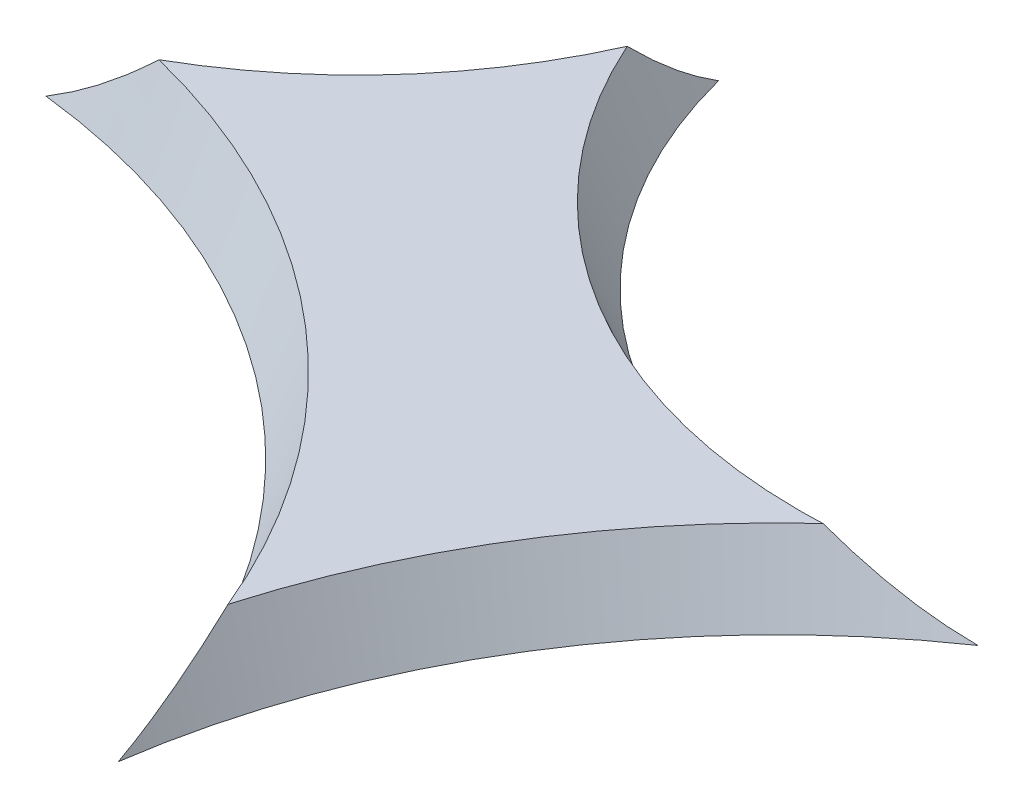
ISO-10303-21;
HEADER;
FILE_DESCRIPTION(('STEP AP214'),'2;1');
FILE_NAME('part.step','',(''),(''),'','','');
FILE_SCHEMA(('AUTOMOTIVE_DESIGN { 1 0 10303 214 1 1 1 1 }'));
ENDSEC;
DATA;
#1=APPLICATION_CONTEXT('core data for automotive mechanical design processes');
#2=APPLICATION_PROTOCOL_DEFINITION('international standard','automotive_design',2000,#1);
#3=PRODUCT_CONTEXT('',#1,'mechanical');
#4=PRODUCT('Part','Part','',(#3));
#5=PRODUCT_RELATED_PRODUCT_CATEGORY('part','',(#4));
#6=PRODUCT_DEFINITION_FORMATION('','',#4);
#7=PRODUCT_DEFINITION_CONTEXT('part definition',#1,'design');
#8=PRODUCT_DEFINITION('design','',#6,#7);
#9=PRODUCT_DEFINITION_SHAPE('','',#8);
#10=(LENGTH_UNIT() NAMED_UNIT(*) SI_UNIT(.MILLI.,.METRE.));
#11=(NAMED_UNIT(*) PLANE_ANGLE_UNIT() SI_UNIT($,.RADIAN.));
#12=(NAMED_UNIT(*) SI_UNIT($,.STERADIAN.) SOLID_ANGLE_UNIT());
#13=UNCERTAINTY_MEASURE_WITH_UNIT(LENGTH_MEASURE(1.E-05),#10,'distance_accuracy_value','');
#14=(GEOMETRIC_REPRESENTATION_CONTEXT(3) GLOBAL_UNCERTAINTY_ASSIGNED_CONTEXT((#13)) GLOBAL_UNIT_ASSIGNED_CONTEXT((#10,
#11,#12)) REPRESENTATION_CONTEXT('',''));
#15=CARTESIAN_POINT('',(0.,0.,0.));
#16=DIRECTION('',(0.,0.,1.));
#17=DIRECTION('',(1.,0.,0.));
#18=AXIS2_PLACEMENT_3D('',#15,#16,#17);
#19=CARTESIAN_POINT('',(-32.,12.,1.3));
#20=DIRECTION('',(0.,1.,0.));
#21=DIRECTION('',(0.,0.,1.));
#22=AXIS2_PLACEMENT_3D('',#19,#20,#21);
#23=CONICAL_SURFACE('',#22,8.49,0.380506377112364);
#24=CARTESIAN_POINT('',(-31.0491448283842,12.0000000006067,-7.13658547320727));
#25=CARTESIAN_POINT('',(-30.9989807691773,12.0277789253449,-7.14211384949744));
#26=CARTESIAN_POINT('',(-30.9493711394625,12.0565388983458,-7.14767636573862));
#27=CARTESIAN_POINT('',(-30.8501212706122,12.1165249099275,-7.15898165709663));
#28=CARTESIAN_POINT('',(-30.8005060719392,12.1477921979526,-7.16472565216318));
#29=CARTESIAN_POINT('',(-30.7012075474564,12.2127899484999,-7.17639148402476));
#30=CARTESIAN_POINT('',(-30.6515513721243,12.2465616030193,-7.18231427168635));
#31=CARTESIAN_POINT('',(-30.5521315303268,12.3165690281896,-7.19433835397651));
#32=CARTESIAN_POINT('',(-30.5023966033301,12.3528454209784,-7.20044039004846));
#33=CARTESIAN_POINT('',(-30.4027826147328,12.4278628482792,-7.2128249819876));
#34=CARTESIAN_POINT('',(-30.3529334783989,12.4666434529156,-7.21910810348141));
#35=CARTESIAN_POINT('',(-30.2530559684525,12.5466708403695,-7.23185853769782));
#36=CARTESIAN_POINT('',(-30.2030582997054,12.5879558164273,-7.23832629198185));
#37=CARTESIAN_POINT('',(-30.1028503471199,12.6729923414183,-7.25145089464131));
#38=CARTESIAN_POINT('',(-30.0526711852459,12.7167804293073,-7.25810810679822));
#39=CARTESIAN_POINT('',(-29.9520691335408,12.8068291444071,-7.27161824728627));
#40=CARTESIAN_POINT('',(-29.9016774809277,12.8531246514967,-7.27847152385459));
#41=CARTESIAN_POINT('',(-29.8518383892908,12.900000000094,-7.28533061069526));
#42=B_SPLINE_CURVE_WITH_KNOTS('',3,(#24,#25,#26,#27,#28,#29,#30,#31,#32,#33,#34,#35,#36,#37,#38,
#39,#40,#41),.UNSPECIFIED.,.F.,.F.,(4,2,2,2,2,2,2,2,4),(0.,0.172803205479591,0.349542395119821,
0.530539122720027,0.716090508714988,0.906470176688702,1.10192941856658,1.30269850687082,
1.50898808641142),.UNSPECIFIED.);
#43=CARTESIAN_POINT('',(-31.0491448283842,12.0000000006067,-7.13658547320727));
#44=VERTEX_POINT('',#43);
#45=CARTESIAN_POINT('',(-29.8518383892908,12.900000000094,-7.28533061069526));
#46=VERTEX_POINT('',#45);
#47=EDGE_CURVE('E11',#44,#46,#42,.T.);
#48=ORIENTED_EDGE('',*,*,#47,.F.);
#49=CARTESIAN_POINT('',(-32.,12.,1.3));
#50=DIRECTION('',(0.,1.,0.));
#51=DIRECTION('',(0.,0.,1.));
#52=AXIS2_PLACEMENT_3D('',#49,#50,#51);
#53=CIRCLE('',#52,8.49);
#54=CARTESIAN_POINT('',(-23.7484033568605,12.0000000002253,-0.697812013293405));
#55=VERTEX_POINT('',#54);
#56=EDGE_CURVE('E75',#55,#44,#53,.T.);
#57=ORIENTED_EDGE('',*,*,#56,.F.);
#58=CARTESIAN_POINT('',(-23.8193803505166,12.9000000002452,-2.07638299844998));
#59=CARTESIAN_POINT('',(-23.816252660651,12.8524980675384,-2.0189980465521));
#60=CARTESIAN_POINT('',(-23.8131104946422,12.8056964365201,-1.96102786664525));
#61=CARTESIAN_POINT('',(-23.8068776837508,12.7147823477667,-1.84527738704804));
#62=CARTESIAN_POINT('',(-23.8037876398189,12.6706321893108,-1.78752663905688));
#63=CARTESIAN_POINT('',(-23.7976610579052,12.5850185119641,-1.6721829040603));
#64=CARTESIAN_POINT('',(-23.7946249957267,12.5435160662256,-1.61461884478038));
#65=CARTESIAN_POINT('',(-23.7886071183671,12.4632001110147,-1.49961655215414));
#66=CARTESIAN_POINT('',(-23.7856256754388,12.4243465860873,-1.44220628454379));
#67=CARTESIAN_POINT('',(-23.7797165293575,12.3493291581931,-1.32747901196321));
#68=CARTESIAN_POINT('',(-23.7767891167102,12.3131245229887,-1.27018867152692));
#69=CARTESIAN_POINT('',(-23.7709861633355,12.2434056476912,-1.15566873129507));
#70=CARTESIAN_POINT('',(-23.7681108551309,12.2098503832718,-1.098464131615));
#71=CARTESIAN_POINT('',(-23.7624089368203,12.1454300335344,-0.984081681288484));
#72=CARTESIAN_POINT('',(-23.7595825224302,12.1145241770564,-0.926926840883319));
#73=CARTESIAN_POINT('',(-23.7539734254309,12.0554034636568,-0.81261394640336));
#74=CARTESIAN_POINT('',(-23.7511909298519,12.0271486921,-0.75547650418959));
#75=CARTESIAN_POINT('',(-23.7484033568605,12.0000000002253,-0.697812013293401));
#76=B_SPLINE_CURVE_WITH_KNOTS('',3,(#58,#59,#60,#61,#62,#63,#64,#65,#66,#67,#68,#69,#70,#71,#72,
#73,#74,#75),.UNSPECIFIED.,.F.,.F.,(4,2,2,2,2,2,2,2,4),(0.,0.223682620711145,0.441935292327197,
0.654996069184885,0.863122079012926,1.06659048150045,1.26569927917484,1.46076792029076,
1.65213762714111),.UNSPECIFIED.);
#77=CARTESIAN_POINT('',(-23.8193803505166,12.9000000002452,-2.07638299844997));
#78=VERTEX_POINT('',#77);
#79=EDGE_CURVE('E27',#78,#55,#76,.T.);
#80=ORIENTED_EDGE('',*,*,#79,.F.);
#81=CARTESIAN_POINT('',(-32.,12.9,1.3));
#82=DIRECTION('',(0.,1.,0.));
#83=DIRECTION('',(0.,0.,1.));
#84=AXIS2_PLACEMENT_3D('',#81,#82,#83);
#85=CIRCLE('',#84,8.85);
#86=EDGE_CURVE('E78',#78,#46,#85,.T.);
#87=ORIENTED_EDGE('',*,*,#86,.T.);
#88=EDGE_LOOP('',(#48,#57,#80,#87));
#89=FACE_BOUND('',#88,.T.);
#90=ADVANCED_FACE('F16',(#89),#23,.F.);
#91=CARTESIAN_POINT('',(-33.,12.,-12.8));
#92=DIRECTION('',(0.,1.,0.));
#93=DIRECTION('',(0.,0.,1.));
#94=AXIS2_PLACEMENT_3D('',#91,#92,#93);
#95=CONICAL_SURFACE('',#94,5.99,0.380506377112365);
#96=CARTESIAN_POINT('',(-27.2,12.899999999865,-10.2149468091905));
#97=CARTESIAN_POINT('',(-27.2000000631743,12.8537156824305,-10.2604288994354));
#98=CARTESIAN_POINT('',(-27.2000030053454,12.8079213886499,-10.3064154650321));
#99=CARTESIAN_POINT('',(-27.2000113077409,12.7187288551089,-10.3981729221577));
#100=CARTESIAN_POINT('',(-27.2000165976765,12.6752994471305,-10.4439135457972));
#101=CARTESIAN_POINT('',(-27.2000264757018,12.5908342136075,-10.5352076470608));
#102=CARTESIAN_POINT('',(-27.2000310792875,12.5497654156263,-10.5807305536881));
#103=CARTESIAN_POINT('',(-27.2000376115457,12.4700244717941,-10.6716198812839));
#104=CARTESIAN_POINT('',(-27.2000396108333,12.4313174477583,-10.7169556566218));
#105=CARTESIAN_POINT('',(-27.2000400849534,12.3563015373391,-10.8075019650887));
#106=CARTESIAN_POINT('',(-27.2000386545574,12.3199560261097,-10.852682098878));
#107=CARTESIAN_POINT('',(-27.200032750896,12.2496652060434,-10.9429489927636));
#108=CARTESIAN_POINT('',(-27.2000283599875,12.2156817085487,-10.9880059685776));
#109=CARTESIAN_POINT('',(-27.2000182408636,12.1501153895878,-11.0780598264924));
#110=CARTESIAN_POINT('',(-27.2000125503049,12.1184931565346,-11.1230279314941));
#111=CARTESIAN_POINT('',(-27.2000036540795,12.0576540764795,-11.2129351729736));
#112=CARTESIAN_POINT('',(-27.2000003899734,12.028396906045,-11.2578470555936));
#113=CARTESIAN_POINT('',(-27.2,12.0000000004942,-11.3033036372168));
#114=B_SPLINE_CURVE_WITH_KNOTS('',3,(#96,#97,#98,#99,#100,#101,#102,#103,#104,#105,#106,#107,
#108,#109,#110,#111,#112,#113),.UNSPECIFIED.,.F.,.F.,(4,2,2,2,2,2,2,2,4),(0.,0.194675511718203,
0.383879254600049,0.567789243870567,0.746600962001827,0.920528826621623,1.08980765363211,
1.25469406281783,1.4154677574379),.UNSPECIFIED.);
#115=CARTESIAN_POINT('',(-27.2,12.899999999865,-10.2149468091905));
#116=VERTEX_POINT('',#115);
#117=CARTESIAN_POINT('',(-27.2,12.0000000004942,-11.3033036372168));
#118=VERTEX_POINT('',#117);
#119=EDGE_CURVE('E86',#116,#118,#114,.T.);
#120=ORIENTED_EDGE('',*,*,#119,.T.);
#121=CARTESIAN_POINT('',(-33.,12.,-12.8));
#122=DIRECTION('',(0.,1.,0.));
#123=DIRECTION('',(0.,0.,1.));
#124=AXIS2_PLACEMENT_3D('',#121,#122,#123);
#125=CIRCLE('',#124,5.99);
#126=EDGE_CURVE('E83',#44,#118,#125,.T.);
#127=ORIENTED_EDGE('',*,*,#126,.F.);
#128=ORIENTED_EDGE('',*,*,#47,.T.);
#129=CARTESIAN_POINT('',(-33.,12.9,-12.8));
#130=DIRECTION('',(0.,1.,0.));
#131=DIRECTION('',(0.,0.,1.));
#132=AXIS2_PLACEMENT_3D('',#129,#130,#131);
#133=CIRCLE('',#132,6.35);
#134=EDGE_CURVE('E109',#46,#116,#133,.T.);
#135=ORIENTED_EDGE('',*,*,#134,.T.);
#136=EDGE_LOOP('',(#120,#127,#128,#135));
#137=FACE_BOUND('',#136,.T.);
#138=ADVANCED_FACE('F84',(#137),#95,.F.);
#139=CARTESIAN_POINT('',(-14.6,12.,0.6));
#140=DIRECTION('',(0.,1.,0.));
#141=DIRECTION('',(0.,0.,1.));
#142=AXIS2_PLACEMENT_3D('',#139,#140,#141);
#143=CONICAL_SURFACE('',#142,9.24,0.380506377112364);
#144=ORIENTED_EDGE('',*,*,#79,.T.);
#145=CARTESIAN_POINT('',(-14.6,12.,0.6));
#146=DIRECTION('',(0.,1.,0.));
#147=DIRECTION('',(0.,0.,1.));
#148=AXIS2_PLACEMENT_3D('',#145,#146,#147);
#149=CIRCLE('',#148,9.24);
#150=CARTESIAN_POINT('',(-19.8251282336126,12.,-7.02073716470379));
#151=VERTEX_POINT('',#150);
#152=EDGE_CURVE('E95',#151,#55,#149,.T.);
#153=ORIENTED_EDGE('',*,*,#152,.F.);
#154=CARTESIAN_POINT('',(-19.825128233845,11.9999999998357,-7.0207371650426));
#155=CARTESIAN_POINT('',(-19.878333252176,12.0244336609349,-6.99610746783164));
#156=CARTESIAN_POINT('',(-19.9310378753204,12.0503207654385,-6.97186804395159));
#157=CARTESIAN_POINT('',(-20.0366043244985,12.1053669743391,-6.92362296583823));
#158=CARTESIAN_POINT('',(-20.0894425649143,12.1345870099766,-6.89963510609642));
#159=CARTESIAN_POINT('',(-20.195322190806,12.1962943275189,-6.85187515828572));
#160=CARTESIAN_POINT('',(-20.2483356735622,12.22884499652,-6.82812343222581));
#161=CARTESIAN_POINT('',(-20.3546169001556,12.2972120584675,-6.78081238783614));
#162=CARTESIAN_POINT('',(-20.4078531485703,12.3330927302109,-6.75727541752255));
#163=CARTESIAN_POINT('',(-20.5146266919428,12.4081192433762,-6.71037094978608));
#164=CARTESIAN_POINT('',(-20.5681294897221,12.4473289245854,-6.6870273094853));
#165=CARTESIAN_POINT('',(-20.6754811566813,12.5290148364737,-6.64048558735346));
#166=CARTESIAN_POINT('',(-20.729293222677,12.5715534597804,-6.61731235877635));
#167=CARTESIAN_POINT('',(-20.8373056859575,12.6598971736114,-6.57108699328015));
#168=CARTESIAN_POINT('',(-20.8914676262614,12.7057623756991,-6.54806023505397));
#169=CARTESIAN_POINT('',(-21.0002205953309,12.8007690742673,-6.50210310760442));
#170=CARTESIAN_POINT('',(-21.0547721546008,12.8499681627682,-6.47919823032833));
#171=CARTESIAN_POINT('',(-21.1087016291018,12.9000000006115,-6.45668499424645));
#172=B_SPLINE_CURVE_WITH_KNOTS('',3,(#154,#155,#156,#157,#158,#159,#160,#161,#162,#163,#164,
#165,#166,#167,#168,#169,#170,#171),.UNSPECIFIED.,.F.,.F.,(4,2,2,2,2,2,2,2,4),(0.,
0.190514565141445,0.385353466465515,0.585059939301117,0.790136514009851,1.00104544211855,
1.21820996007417,1.44201615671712,1.67281523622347),.UNSPECIFIED.);
#173=CARTESIAN_POINT('',(-21.1087016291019,12.9000000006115,-6.45668499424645));
#174=VERTEX_POINT('',#173);
#175=EDGE_CURVE('E154',#151,#174,#172,.T.);
#176=ORIENTED_EDGE('',*,*,#175,.T.);
#177=CARTESIAN_POINT('',(-14.6,12.9,0.6));
#178=DIRECTION('',(0.,1.,0.));
#179=DIRECTION('',(0.,0.,1.));
#180=AXIS2_PLACEMENT_3D('',#177,#178,#179);
#181=CIRCLE('',#180,9.6);
#182=EDGE_CURVE('E91',#174,#78,#181,.T.);
#183=ORIENTED_EDGE('',*,*,#182,.T.);
#184=EDGE_LOOP('',(#144,#153,#176,#183));
#185=FACE_BOUND('',#184,.T.);
#186=ADVANCED_FACE('F124',(#185),#143,.F.);
#187=CARTESIAN_POINT('',(-29.90429721,12.9,-2.027551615));
#188=DIRECTION('',(0.,-1.,0.));
#189=DIRECTION('',(0.,0.,-1.));
#190=AXIS2_PLACEMENT_3D('',#187,#188,#189);
#191=PLANE('',#190);
#192=ORIENTED_EDGE('',*,*,#182,.F.);
#193=CARTESIAN_POINT('',(-21.4,12.9,-12.8));
#194=DIRECTION('',(0.,1.,0.));
#195=DIRECTION('',(0.,0.,1.));
#196=AXIS2_PLACEMENT_3D('',#193,#194,#195);
#197=CIRCLE('',#196,6.35);
#198=CARTESIAN_POINT('',(-21.4,12.9,-6.45));
#199=VERTEX_POINT('',#198);
#200=EDGE_CURVE('E196',#199,#174,#197,.T.);
#201=ORIENTED_EDGE('',*,*,#200,.F.);
#202=CARTESIAN_POINT('',(-21.4,12.9,-12.8));
#203=DIRECTION('',(0.,1.,0.));
#204=DIRECTION('',(0.,0.,1.));
#205=AXIS2_PLACEMENT_3D('',#202,#203,#204);
#206=CIRCLE('',#205,6.35);
#207=EDGE_CURVE('E100',#116,#199,#206,.T.);
#208=ORIENTED_EDGE('',*,*,#207,.F.);
#209=ORIENTED_EDGE('',*,*,#134,.F.);
#210=ORIENTED_EDGE('',*,*,#86,.F.);
#211=EDGE_LOOP('',(#192,#201,#208,#209,#210));
#212=FACE_BOUND('',#211,.T.);
#213=ADVANCED_FACE('F133',(#212),#191,.F.);
#214=CARTESIAN_POINT('',(-31.116488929,12.,-0.634179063));
#215=DIRECTION('',(0.,-1.,0.));
#216=DIRECTION('',(0.,0.,-1.));
#217=AXIS2_PLACEMENT_3D('',#214,#215,#216);
#218=PLANE('',#217);
#219=CARTESIAN_POINT('',(-21.4,12.,-12.8));
#220=DIRECTION('',(0.,-1.,0.));
#221=DIRECTION('',(0.,0.,1.));
#222=AXIS2_PLACEMENT_3D('',#219,#220,#221);
#223=CIRCLE('',#222,5.99);
#224=CARTESIAN_POINT('',(-21.4,12.,-6.81));
#225=VERTEX_POINT('',#224);
#226=EDGE_CURVE('E159',#151,#225,#223,.T.);
#227=ORIENTED_EDGE('',*,*,#226,.F.);
#228=ORIENTED_EDGE('',*,*,#152,.T.);
#229=ORIENTED_EDGE('',*,*,#56,.T.);
#230=ORIENTED_EDGE('',*,*,#126,.T.);
#231=CARTESIAN_POINT('',(-21.4,12.,-12.8));
#232=DIRECTION('',(0.,-1.,0.));
#233=DIRECTION('',(0.,0.,1.));
#234=AXIS2_PLACEMENT_3D('',#231,#232,#233);
#235=CIRCLE('',#234,5.99);
#236=EDGE_CURVE('E189',#225,#118,#235,.T.);
#237=ORIENTED_EDGE('',*,*,#236,.F.);
#238=EDGE_LOOP('',(#227,#228,#229,#230,#237));
#239=FACE_BOUND('',#238,.T.);
#240=ADVANCED_FACE('F94',(#239),#218,.T.);
#241=CARTESIAN_POINT('',(-21.4,12.,-12.8));
#242=DIRECTION('',(0.,1.,0.));
#243=DIRECTION('',(0.,0.,1.));
#244=AXIS2_PLACEMENT_3D('',#241,#242,#243);
#245=CONICAL_SURFACE('',#244,5.99,0.380506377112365);
#246=DIRECTION('',(0.,0.928476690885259,0.371390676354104));
#247=VECTOR('',#246,1.);
#248=CARTESIAN_POINT('',(-21.4,12.,-6.81));
#249=LINE('',#248,#247);
#250=EDGE_CURVE('E199',#225,#199,#249,.T.);
#251=ORIENTED_EDGE('',*,*,#250,.F.);
#252=ORIENTED_EDGE('',*,*,#236,.T.);
#253=ORIENTED_EDGE('',*,*,#119,.F.);
#254=ORIENTED_EDGE('',*,*,#207,.T.);
#255=EDGE_LOOP('',(#251,#252,#253,#254));
#256=FACE_BOUND('',#255,.T.);
#257=ADVANCED_FACE('F170',(#256),#245,.F.);
#258=CARTESIAN_POINT('',(-21.4,12.,-12.8));
#259=DIRECTION('',(0.,1.,0.));
#260=DIRECTION('',(0.,0.,1.));
#261=AXIS2_PLACEMENT_3D('',#258,#259,#260);
#262=CONICAL_SURFACE('',#261,5.99,0.380506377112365);
#263=ORIENTED_EDGE('',*,*,#226,.T.);
#264=ORIENTED_EDGE('',*,*,#250,.T.);
#265=ORIENTED_EDGE('',*,*,#200,.T.);
#266=ORIENTED_EDGE('',*,*,#175,.F.);
#267=EDGE_LOOP('',(#263,#264,#265,#266));
#268=FACE_BOUND('',#267,.T.);
#269=ADVANCED_FACE('F161',(#268),#262,.F.);
#270=CLOSED_SHELL('',(#90,#138,#186,#213,#240,#257,#269));
#271=MANIFOLD_SOLID_BREP('B1',#270);
#272=ADVANCED_BREP_SHAPE_REPRESENTATION('',(#18,#271),#14);
#273=SHAPE_DEFINITION_REPRESENTATION(#9,#272);
ENDSEC;
END-ISO-10303-21;
